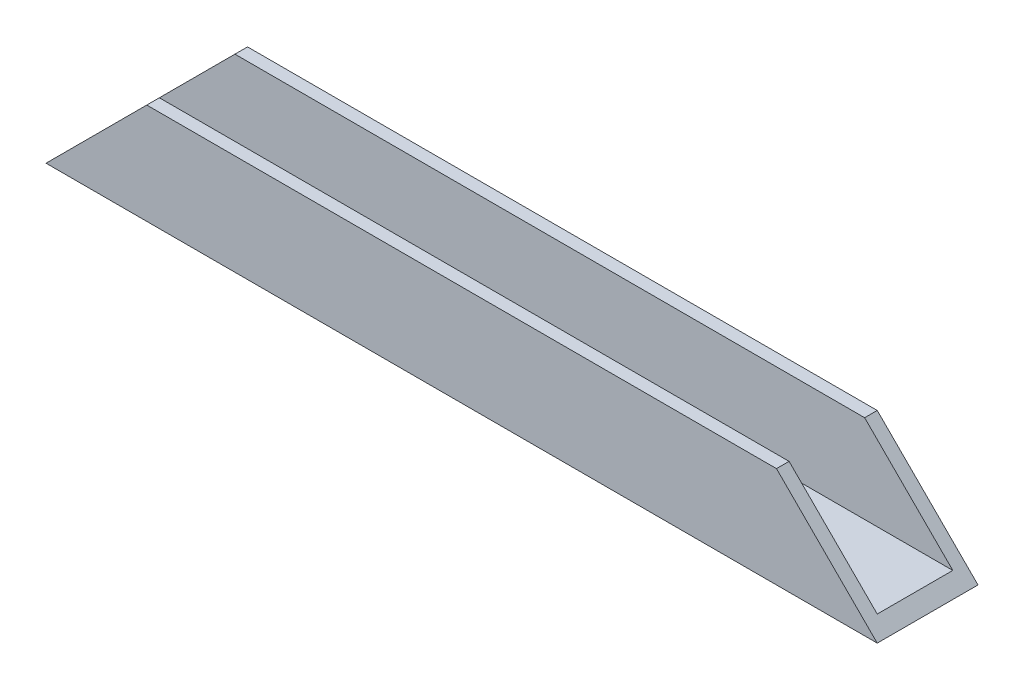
from build123d import *

# Parameters (mm, degrees)
BOSS_EXTRUDE1_DEPTH = 104.775
SKETCH2_OUTSIDE_W   = 254.072
SKETCH2_OUTSIDE_H   = 69.922
CUT_EXTRUDE1_DEPTH  = 111.076842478


with BuildPart() as part:
    # Sketch1 → Boss-Extrude1 (new, symmetric)
    with BuildSketch(Plane(origin=(0, 0, 0), x_dir=(0, 0, -1), z_dir=(1, 0, 0))):
        Polygon((-9.525, 0), (9.525, 0), (9.525, 22.225), (12.7, 22.225), (12.7, -3.175), (-12.7, -3.175), (-12.7, 22.225), (-9.525, 22.225), align=None)
    extrude(amount=BOSS_EXTRUDE1_DEPTH, both=True)

    # Sketch2 outside → Cut-Extrude1 (cut, through all)
    with BuildSketch(Plane.XY.offset(12.7)):
        with Locations((0, 9.525)):
            Rectangle(SKETCH2_OUTSIDE_W, SKETCH2_OUTSIDE_H)
        Polygon((-104.775, -3.175), (-79.375, 22.225), (79.375, 22.225), (104.775, -3.175), align=None, mode=Mode.SUBTRACT)
    extrude(amount=-CUT_EXTRUDE1_DEPTH, mode=Mode.SUBTRACT)


solid = part.part
